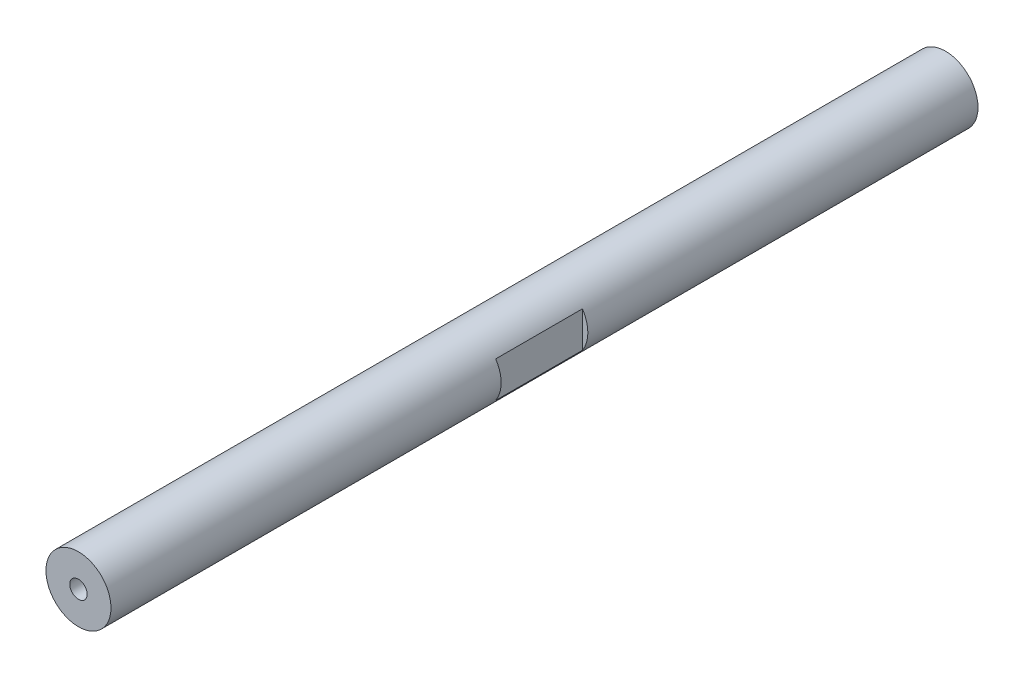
from build123d import *

# Parameters (mm, degrees)
SKETCH1_R               = 9.525
BOSS_EXTRUDE1_DEPTH     = 127
CUT_EXTRUDE1_DEPTH      = 128.712377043
CUT_EXTRUDE1_DEPTH_BACK = 128.712377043
SKETCH5_W               = 1.5875
SKETCH5_H               = 25.4


with BuildPart() as part:
    # Sketch1 → Boss-Extrude1 (new, symmetric)
    with BuildSketch(Plane.XY):
        Circle(SKETCH1_R)
    extrude(amount=BOSS_EXTRUDE1_DEPTH, both=True)

    # Sketch4 → 1_4-20 Tapped Hole1 (revolve, cut)
    with BuildSketch(Plane(origin=(0, 0, 127), x_dir=(0, -1, 0), z_dir=(1, 0, 0))):
        Polygon((0, 0), (0, 33.283816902), (2.5527, 31.75), (2.5527, 0), align=None)
    f_1_4_20_tapped_hole1 = revolve(axis=Axis((0, 0, 133.35), (0, 0, -1)), mode=Mode.SUBTRACT)

    # Mirror1: 1_4-20 Tapped Hole1 across plane
    add(f_1_4_20_tapped_hole1.mirror(Plane.XY), mode=Mode.SUBTRACT)

    # Sketch5 → Cut-Extrude1 (cut, two sides: drawn at the far end of the back side and taken through both)
    with BuildSketch(Plane(origin=(0, 0, 0), x_dir=(1, 0, 0), z_dir=(0, 1, 0)).offset(-CUT_EXTRUDE1_DEPTH_BACK)):
        with Locations((-8.73125, 0)):
            Rectangle(SKETCH5_W, SKETCH5_H)
        with Locations((8.73125, 0)):
            Rectangle(SKETCH5_W, SKETCH5_H)
    extrude(amount=CUT_EXTRUDE1_DEPTH + CUT_EXTRUDE1_DEPTH_BACK, mode=Mode.SUBTRACT)


solid = part.part
